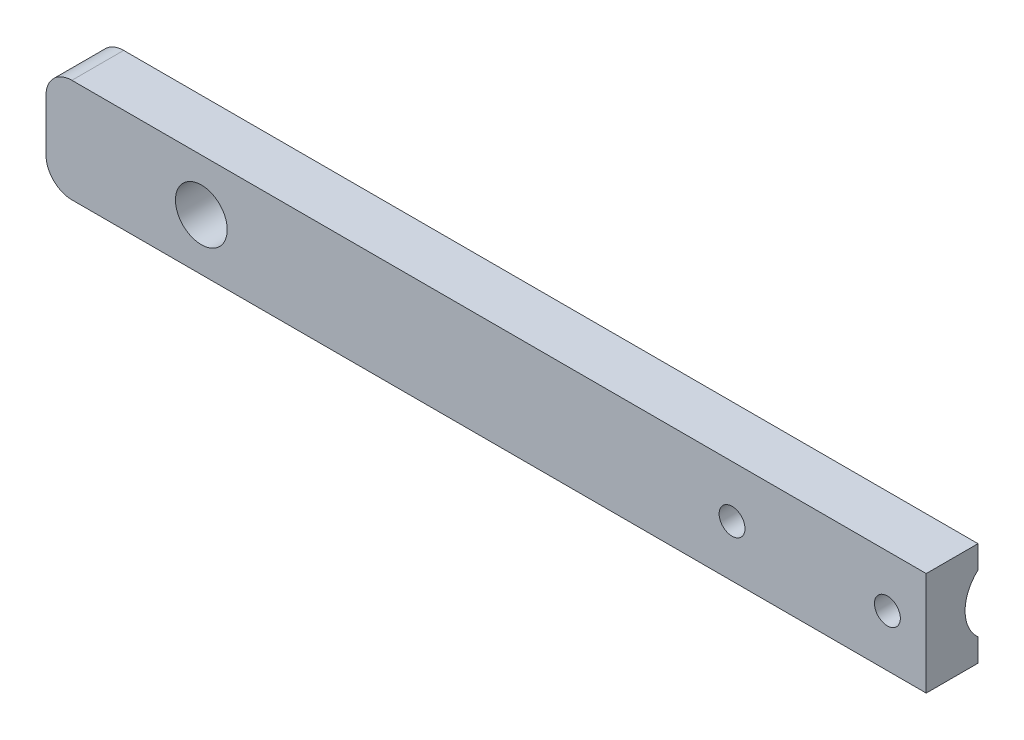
ISO-10303-21;
HEADER;
FILE_DESCRIPTION(('STEP AP214'),'2;1');
FILE_NAME('part.step','',(''),(''),'','','');
FILE_SCHEMA(('AUTOMOTIVE_DESIGN { 1 0 10303 214 1 1 1 1 }'));
ENDSEC;
DATA;
#1=APPLICATION_CONTEXT('core data for automotive mechanical design processes');
#2=APPLICATION_PROTOCOL_DEFINITION('international standard','automotive_design',2000,#1);
#3=PRODUCT_CONTEXT('',#1,'mechanical');
#4=PRODUCT('Part','Part','',(#3));
#5=PRODUCT_RELATED_PRODUCT_CATEGORY('part','',(#4));
#6=PRODUCT_DEFINITION_FORMATION('','',#4);
#7=PRODUCT_DEFINITION_CONTEXT('part definition',#1,'design');
#8=PRODUCT_DEFINITION('design','',#6,#7);
#9=PRODUCT_DEFINITION_SHAPE('','',#8);
#10=(LENGTH_UNIT() NAMED_UNIT(*) SI_UNIT(.MILLI.,.METRE.));
#11=(NAMED_UNIT(*) PLANE_ANGLE_UNIT() SI_UNIT($,.RADIAN.));
#12=(NAMED_UNIT(*) SI_UNIT($,.STERADIAN.) SOLID_ANGLE_UNIT());
#13=UNCERTAINTY_MEASURE_WITH_UNIT(LENGTH_MEASURE(1.E-05),#10,'distance_accuracy_value','');
#14=(GEOMETRIC_REPRESENTATION_CONTEXT(3) GLOBAL_UNCERTAINTY_ASSIGNED_CONTEXT((#13)) GLOBAL_UNIT_ASSIGNED_CONTEXT((#10,
#11,#12)) REPRESENTATION_CONTEXT('',''));
#15=CARTESIAN_POINT('',(0.,0.,0.));
#16=DIRECTION('',(0.,0.,1.));
#17=DIRECTION('',(1.,0.,0.));
#18=AXIS2_PLACEMENT_3D('',#15,#16,#17);
#19=CARTESIAN_POINT('',(0.,0.,6.35));
#20=DIRECTION('',(0.,0.,1.));
#21=DIRECTION('',(1.,0.,0.));
#22=AXIS2_PLACEMENT_3D('',#19,#20,#21);
#23=PLANE('',#22);
#24=CARTESIAN_POINT('',(168.275,0.,6.35));
#25=DIRECTION('',(0.,0.,1.));
#26=DIRECTION('',(1.,0.,0.));
#27=AXIS2_PLACEMENT_3D('',#24,#25,#26);
#28=CIRCLE('',#27,3.175);
#29=CARTESIAN_POINT('',(171.45,0.,6.35));
#30=VERTEX_POINT('',#29);
#31=EDGE_CURVE('E127',#30,#30,#28,.T.);
#32=ORIENTED_EDGE('',*,*,#31,.F.);
#33=EDGE_LOOP('',(#32));
#34=FACE_BOUND('',#33,.T.);
#35=DIRECTION('',(0.,-1.,0.));
#36=VECTOR('',#35,1.);
#37=CARTESIAN_POINT('',(-38.1,12.7,6.35));
#38=LINE('',#37,#36);
#39=CARTESIAN_POINT('',(-38.1,6.35,6.35));
#40=VERTEX_POINT('',#39);
#41=CARTESIAN_POINT('',(-38.1,-6.35,6.35));
#42=VERTEX_POINT('',#41);
#43=EDGE_CURVE('E137',#40,#42,#38,.T.);
#44=ORIENTED_EDGE('',*,*,#43,.T.);
#45=CARTESIAN_POINT('',(-31.75,-6.35,6.35));
#46=DIRECTION('',(0.,0.,1.));
#47=DIRECTION('',(1.,0.,0.));
#48=AXIS2_PLACEMENT_3D('',#45,#46,#47);
#49=CIRCLE('',#48,6.35);
#50=CARTESIAN_POINT('',(-31.75,-12.7,6.35));
#51=VERTEX_POINT('',#50);
#52=EDGE_CURVE('E175',#42,#51,#49,.T.);
#53=ORIENTED_EDGE('',*,*,#52,.T.);
#54=DIRECTION('',(1.,0.,0.));
#55=VECTOR('',#54,1.);
#56=CARTESIAN_POINT('',(-38.1,-12.7,6.35));
#57=LINE('',#56,#55);
#58=CARTESIAN_POINT('',(177.8,-12.7,6.35));
#59=VERTEX_POINT('',#58);
#60=EDGE_CURVE('E140',#51,#59,#57,.T.);
#61=ORIENTED_EDGE('',*,*,#60,.T.);
#62=DIRECTION('',(0.,1.,0.));
#63=VECTOR('',#62,1.);
#64=CARTESIAN_POINT('',(177.8,-12.7,6.35));
#65=LINE('',#64,#63);
#66=CARTESIAN_POINT('',(177.8,12.7,6.35));
#67=VERTEX_POINT('',#66);
#68=EDGE_CURVE('E143',#59,#67,#65,.T.);
#69=ORIENTED_EDGE('',*,*,#68,.T.);
#70=DIRECTION('',(-1.,0.,0.));
#71=VECTOR('',#70,1.);
#72=CARTESIAN_POINT('',(177.8,12.7,6.35));
#73=LINE('',#72,#71);
#74=CARTESIAN_POINT('',(-31.7499999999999,12.7,6.35));
#75=VERTEX_POINT('',#74);
#76=EDGE_CURVE('E145',#67,#75,#73,.T.);
#77=ORIENTED_EDGE('',*,*,#76,.T.);
#78=CARTESIAN_POINT('',(-31.75,6.35,6.35));
#79=DIRECTION('',(0.,0.,1.));
#80=DIRECTION('',(1.,0.,0.));
#81=AXIS2_PLACEMENT_3D('',#78,#79,#80);
#82=CIRCLE('',#81,6.35);
#83=EDGE_CURVE('E173',#75,#40,#82,.T.);
#84=ORIENTED_EDGE('',*,*,#83,.T.);
#85=EDGE_LOOP('',(#44,#53,#61,#69,#77,#84));
#86=FACE_BOUND('',#85,.T.);
#87=CARTESIAN_POINT('',(0.,0.,6.35));
#88=DIRECTION('',(0.,0.,1.));
#89=DIRECTION('',(1.,0.,0.));
#90=AXIS2_PLACEMENT_3D('',#87,#88,#89);
#91=CIRCLE('',#90,6.35);
#92=CARTESIAN_POINT('',(6.35,0.,6.35));
#93=VERTEX_POINT('',#92);
#94=EDGE_CURVE('E131',#93,#93,#91,.T.);
#95=ORIENTED_EDGE('',*,*,#94,.F.);
#96=EDGE_LOOP('',(#95));
#97=FACE_BOUND('',#96,.T.);
#98=CARTESIAN_POINT('',(130.175,0.,6.35));
#99=DIRECTION('',(0.,0.,1.));
#100=DIRECTION('',(1.,0.,0.));
#101=AXIS2_PLACEMENT_3D('',#98,#99,#100);
#102=CIRCLE('',#101,3.175);
#103=CARTESIAN_POINT('',(133.35,0.,6.35));
#104=VERTEX_POINT('',#103);
#105=EDGE_CURVE('E115',#104,#104,#102,.T.);
#106=ORIENTED_EDGE('',*,*,#105,.F.);
#107=EDGE_LOOP('',(#106));
#108=FACE_BOUND('',#107,.T.);
#109=ADVANCED_FACE('F33',(#34,#86,#97,#108),#23,.T.);
#110=CARTESIAN_POINT('',(0.,0.,-6.35));
#111=DIRECTION('',(0.,0.,1.));
#112=DIRECTION('',(1.,0.,0.));
#113=AXIS2_PLACEMENT_3D('',#110,#111,#112);
#114=PLANE('',#113);
#115=DIRECTION('',(0.,1.,0.));
#116=VECTOR('',#115,1.);
#117=CARTESIAN_POINT('',(120.65,0.,-6.35));
#118=LINE('',#117,#116);
#119=CARTESIAN_POINT('',(120.65,-7.09951582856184,-6.35));
#120=VERTEX_POINT('',#119);
#121=CARTESIAN_POINT('',(120.65,7.09951582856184,-6.35));
#122=VERTEX_POINT('',#121);
#123=EDGE_CURVE('E11',#120,#122,#118,.T.);
#124=ORIENTED_EDGE('',*,*,#123,.F.);
#125=DIRECTION('',(1.,0.,0.));
#126=VECTOR('',#125,1.);
#127=CARTESIAN_POINT('',(120.65,-7.09951582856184,-6.35));
#128=LINE('',#127,#126);
#129=CARTESIAN_POINT('',(177.8,-7.09951582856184,-6.35));
#130=VERTEX_POINT('',#129);
#131=EDGE_CURVE('E104',#120,#130,#128,.T.);
#132=ORIENTED_EDGE('',*,*,#131,.T.);
#133=DIRECTION('',(0.,1.,0.));
#134=VECTOR('',#133,1.);
#135=CARTESIAN_POINT('',(177.8,-12.7,-6.35));
#136=LINE('',#135,#134);
#137=CARTESIAN_POINT('',(177.8,-12.7,-6.35));
#138=VERTEX_POINT('',#137);
#139=EDGE_CURVE('E152',#138,#130,#136,.T.);
#140=ORIENTED_EDGE('',*,*,#139,.F.);
#141=DIRECTION('',(1.,0.,0.));
#142=VECTOR('',#141,1.);
#143=CARTESIAN_POINT('',(-38.1,-12.7,-6.35));
#144=LINE('',#143,#142);
#145=CARTESIAN_POINT('',(-31.75,-12.7,-6.35));
#146=VERTEX_POINT('',#145);
#147=EDGE_CURVE('E150',#146,#138,#144,.T.);
#148=ORIENTED_EDGE('',*,*,#147,.F.);
#149=CARTESIAN_POINT('',(-31.75,-6.35,-6.35));
#150=DIRECTION('',(0.,0.,1.));
#151=DIRECTION('',(1.,0.,0.));
#152=AXIS2_PLACEMENT_3D('',#149,#150,#151);
#153=CIRCLE('',#152,6.35);
#154=CARTESIAN_POINT('',(-38.1,-6.35,-6.35));
#155=VERTEX_POINT('',#154);
#156=EDGE_CURVE('E166',#146,#155,#153,.F.);
#157=ORIENTED_EDGE('',*,*,#156,.T.);
#158=DIRECTION('',(0.,-1.,0.));
#159=VECTOR('',#158,1.);
#160=CARTESIAN_POINT('',(-38.1,12.7,-6.35));
#161=LINE('',#160,#159);
#162=CARTESIAN_POINT('',(-38.1,6.35,-6.35));
#163=VERTEX_POINT('',#162);
#164=EDGE_CURVE('E134',#163,#155,#161,.T.);
#165=ORIENTED_EDGE('',*,*,#164,.F.);
#166=CARTESIAN_POINT('',(-31.75,6.35,-6.35));
#167=DIRECTION('',(0.,0.,1.));
#168=DIRECTION('',(1.,0.,0.));
#169=AXIS2_PLACEMENT_3D('',#166,#167,#168);
#170=CIRCLE('',#169,6.35);
#171=CARTESIAN_POINT('',(-31.7499999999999,12.7,-6.35));
#172=VERTEX_POINT('',#171);
#173=EDGE_CURVE('E164',#163,#172,#170,.F.);
#174=ORIENTED_EDGE('',*,*,#173,.T.);
#175=DIRECTION('',(-1.,0.,0.));
#176=VECTOR('',#175,1.);
#177=CARTESIAN_POINT('',(177.8,12.7,-6.35));
#178=LINE('',#177,#176);
#179=CARTESIAN_POINT('',(177.8,12.7,-6.35));
#180=VERTEX_POINT('',#179);
#181=EDGE_CURVE('E141',#180,#172,#178,.T.);
#182=ORIENTED_EDGE('',*,*,#181,.F.);
#183=CARTESIAN_POINT('',(177.8,7.09951582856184,-6.35));
#184=VERTEX_POINT('',#183);
#185=EDGE_CURVE('E112',#184,#180,#136,.T.);
#186=ORIENTED_EDGE('',*,*,#185,.F.);
#187=DIRECTION('',(1.,0.,0.));
#188=VECTOR('',#187,1.);
#189=CARTESIAN_POINT('',(120.65,7.09951582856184,-6.35));
#190=LINE('',#189,#188);
#191=EDGE_CURVE('E48',#184,#122,#190,.F.);
#192=ORIENTED_EDGE('',*,*,#191,.T.);
#193=EDGE_LOOP('',(#124,#132,#140,#148,#157,#165,#174,#182,#186,#192));
#194=FACE_BOUND('',#193,.T.);
#195=CARTESIAN_POINT('',(0.,0.,-6.35));
#196=DIRECTION('',(0.,0.,1.));
#197=DIRECTION('',(1.,0.,0.));
#198=AXIS2_PLACEMENT_3D('',#195,#196,#197);
#199=CIRCLE('',#198,6.35);
#200=CARTESIAN_POINT('',(6.35,0.,-6.35));
#201=VERTEX_POINT('',#200);
#202=EDGE_CURVE('E130',#201,#201,#199,.T.);
#203=ORIENTED_EDGE('',*,*,#202,.T.);
#204=EDGE_LOOP('',(#203));
#205=FACE_BOUND('',#204,.T.);
#206=ADVANCED_FACE('F109',(#194,#205),#114,.F.);
#207=CARTESIAN_POINT('',(-38.1,12.7,6.35));
#208=DIRECTION('',(1.,0.,0.));
#209=DIRECTION('',(0.,0.,-1.));
#210=AXIS2_PLACEMENT_3D('',#207,#208,#209);
#211=PLANE('',#210);
#212=ORIENTED_EDGE('',*,*,#164,.T.);
#213=DIRECTION('',(0.,0.,-1.));
#214=VECTOR('',#213,1.);
#215=CARTESIAN_POINT('',(-38.1,-6.35,6.35));
#216=LINE('',#215,#214);
#217=EDGE_CURVE('E171',#155,#42,#216,.F.);
#218=ORIENTED_EDGE('',*,*,#217,.T.);
#219=ORIENTED_EDGE('',*,*,#43,.F.);
#220=DIRECTION('',(0.,0.,-1.));
#221=VECTOR('',#220,1.);
#222=CARTESIAN_POINT('',(-38.1,6.35,6.35));
#223=LINE('',#222,#221);
#224=EDGE_CURVE('E168',#40,#163,#223,.T.);
#225=ORIENTED_EDGE('',*,*,#224,.T.);
#226=EDGE_LOOP('',(#212,#218,#219,#225));
#227=FACE_BOUND('',#226,.T.);
#228=ADVANCED_FACE('F200',(#227),#211,.F.);
#229=CARTESIAN_POINT('',(-38.1,-12.7,6.35));
#230=DIRECTION('',(0.,1.,0.));
#231=DIRECTION('',(0.,0.,1.));
#232=AXIS2_PLACEMENT_3D('',#229,#230,#231);
#233=PLANE('',#232);
#234=ORIENTED_EDGE('',*,*,#60,.F.);
#235=DIRECTION('',(0.,0.,-1.));
#236=VECTOR('',#235,1.);
#237=CARTESIAN_POINT('',(-31.75,-12.7,6.35));
#238=LINE('',#237,#236);
#239=EDGE_CURVE('E161',#51,#146,#238,.T.);
#240=ORIENTED_EDGE('',*,*,#239,.T.);
#241=ORIENTED_EDGE('',*,*,#147,.T.);
#242=DIRECTION('',(0.,0.,-1.));
#243=VECTOR('',#242,1.);
#244=CARTESIAN_POINT('',(177.8,-12.7,6.35));
#245=LINE('',#244,#243);
#246=EDGE_CURVE('E158',#59,#138,#245,.T.);
#247=ORIENTED_EDGE('',*,*,#246,.F.);
#248=EDGE_LOOP('',(#234,#240,#241,#247));
#249=FACE_BOUND('',#248,.T.);
#250=ADVANCED_FACE('F213',(#249),#233,.F.);
#251=CARTESIAN_POINT('',(177.8,-12.7,6.35));
#252=DIRECTION('',(-1.,0.,0.));
#253=DIRECTION('',(0.,0.,1.));
#254=AXIS2_PLACEMENT_3D('',#251,#252,#253);
#255=PLANE('',#254);
#256=ORIENTED_EDGE('',*,*,#139,.T.);
#257=CARTESIAN_POINT('',(177.8,0.,-12.7));
#258=DIRECTION('',(1.,0.,0.));
#259=DIRECTION('',(0.,0.,-1.));
#260=AXIS2_PLACEMENT_3D('',#257,#258,#259);
#261=CIRCLE('',#260,9.525);
#262=EDGE_CURVE('E106',#184,#130,#261,.T.);
#263=ORIENTED_EDGE('',*,*,#262,.F.);
#264=ORIENTED_EDGE('',*,*,#185,.T.);
#265=DIRECTION('',(0.,0.,-1.));
#266=VECTOR('',#265,1.);
#267=CARTESIAN_POINT('',(177.8,12.7,6.35));
#268=LINE('',#267,#266);
#269=EDGE_CURVE('E147',#67,#180,#268,.T.);
#270=ORIENTED_EDGE('',*,*,#269,.F.);
#271=ORIENTED_EDGE('',*,*,#68,.F.);
#272=ORIENTED_EDGE('',*,*,#246,.T.);
#273=EDGE_LOOP('',(#256,#263,#264,#270,#271,#272));
#274=FACE_BOUND('',#273,.T.);
#275=ADVANCED_FACE('F210',(#274),#255,.F.);
#276=CARTESIAN_POINT('',(177.8,12.7,6.35));
#277=DIRECTION('',(0.,-1.,0.));
#278=DIRECTION('',(0.,0.,-1.));
#279=AXIS2_PLACEMENT_3D('',#276,#277,#278);
#280=PLANE('',#279);
#281=ORIENTED_EDGE('',*,*,#181,.T.);
#282=DIRECTION('',(0.,0.,-1.));
#283=VECTOR('',#282,1.);
#284=CARTESIAN_POINT('',(-31.75,12.7,6.35));
#285=LINE('',#284,#283);
#286=EDGE_CURVE('E41',#172,#75,#285,.F.);
#287=ORIENTED_EDGE('',*,*,#286,.T.);
#288=ORIENTED_EDGE('',*,*,#76,.F.);
#289=ORIENTED_EDGE('',*,*,#269,.T.);
#290=EDGE_LOOP('',(#281,#287,#288,#289));
#291=FACE_BOUND('',#290,.T.);
#292=ADVANCED_FACE('F207',(#291),#280,.F.);
#293=CARTESIAN_POINT('',(0.,0.,6.35));
#294=DIRECTION('',(0.,0.,-1.));
#295=DIRECTION('',(-1.,0.,0.));
#296=AXIS2_PLACEMENT_3D('',#293,#294,#295);
#297=CYLINDRICAL_SURFACE('',#296,6.35);
#298=ORIENTED_EDGE('',*,*,#94,.T.);
#299=EDGE_LOOP('',(#298));
#300=FACE_BOUND('',#299,.T.);
#301=ORIENTED_EDGE('',*,*,#202,.F.);
#302=EDGE_LOOP('',(#301));
#303=FACE_BOUND('',#302,.T.);
#304=ADVANCED_FACE('F205',(#300,#303),#297,.F.);
#305=CARTESIAN_POINT('',(168.275,0.,6.35));
#306=DIRECTION('',(0.,0.,-1.));
#307=DIRECTION('',(-1.,0.,0.));
#308=AXIS2_PLACEMENT_3D('',#305,#306,#307);
#309=CYLINDRICAL_SURFACE('',#308,3.175);
#310=CARTESIAN_POINT('',(165.1,0.,-3.17499999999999));
#311=CARTESIAN_POINT('',(165.099999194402,-0.173238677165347,-3.17499951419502));
#312=CARTESIAN_POINT('',(165.114224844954,-0.346472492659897,-3.17976981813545));
#313=CARTESIAN_POINT('',(165.170577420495,-0.687837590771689,-3.19832957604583));
#314=CARTESIAN_POINT('',(165.212707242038,-0.855968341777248,-3.21211996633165));
#315=CARTESIAN_POINT('',(165.323263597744,-1.18215660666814,-3.24722147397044));
#316=CARTESIAN_POINT('',(165.391646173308,-1.34023044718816,-3.2685200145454));
#317=CARTESIAN_POINT('',(165.552568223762,-1.6426654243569,-3.31646384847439));
#318=CARTESIAN_POINT('',(165.645112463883,-1.78702384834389,-3.34311019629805));
#319=CARTESIAN_POINT('',(165.855096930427,-2.0629298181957,-3.39997750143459));
#320=CARTESIAN_POINT('',(165.973224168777,-2.19393674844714,-3.43028408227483));
#321=CARTESIAN_POINT('',(166.229560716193,-2.43469379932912,-3.49058500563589));
#322=CARTESIAN_POINT('',(166.367774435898,-2.54443923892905,-3.52057927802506));
#323=CARTESIAN_POINT('',(166.665227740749,-2.74264419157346,-3.57780169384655));
#324=CARTESIAN_POINT('',(166.824957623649,-2.83040092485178,-3.6049255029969));
#325=CARTESIAN_POINT('',(167.157959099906,-2.97757492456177,-3.65203405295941));
#326=CARTESIAN_POINT('',(167.331226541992,-3.03700083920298,-3.67202097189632));
#327=CARTESIAN_POINT('',(167.680237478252,-3.12379824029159,-3.70169112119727));
#328=CARTESIAN_POINT('',(167.855700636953,-3.15218269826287,-3.71169895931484));
#329=CARTESIAN_POINT('',(168.209162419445,-3.17925806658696,-3.72123790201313));
#330=CARTESIAN_POINT('',(168.387160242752,-3.17795815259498,-3.72077224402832));
#331=CARTESIAN_POINT('',(168.73199880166,-3.14648819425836,-3.70970127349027));
#332=CARTESIAN_POINT('',(168.898977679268,-3.11764017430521,-3.69956029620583));
#333=CARTESIAN_POINT('',(169.225574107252,-3.03404956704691,-3.67104111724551));
#334=CARTESIAN_POINT('',(169.385190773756,-2.9793038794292,-3.65266192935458));
#335=CARTESIAN_POINT('',(169.695535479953,-2.84460650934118,-3.60940632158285));
#336=CARTESIAN_POINT('',(169.846078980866,-2.76426310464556,-3.58443003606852));
#337=CARTESIAN_POINT('',(170.131965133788,-2.58092291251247,-3.53083626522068));
#338=CARTESIAN_POINT('',(170.267303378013,-2.47791958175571,-3.50221772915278));
#339=CARTESIAN_POINT('',(170.52636582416,-2.2458341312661,-3.44273729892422));
#340=CARTESIAN_POINT('',(170.649114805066,-2.11567125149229,-3.41183628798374));
#341=CARTESIAN_POINT('',(170.871296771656,-1.83622813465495,-3.35257970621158));
#342=CARTESIAN_POINT('',(170.970727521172,-1.68694606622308,-3.32422437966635));
#343=CARTESIAN_POINT('',(171.144235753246,-1.37143367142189,-3.27288182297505));
#344=CARTESIAN_POINT('',(171.218051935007,-1.20504990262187,-3.24995063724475));
#345=CARTESIAN_POINT('',(171.336345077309,-0.861279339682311,-3.21244699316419));
#346=CARTESIAN_POINT('',(171.380832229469,-0.683896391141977,-3.19787163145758));
#347=CARTESIAN_POINT('',(171.437476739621,-0.331418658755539,-3.17920284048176));
#348=CARTESIAN_POINT('',(171.450951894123,-0.156557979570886,-3.17468244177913));
#349=CARTESIAN_POINT('',(171.448943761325,0.192960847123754,-3.17535233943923));
#350=CARTESIAN_POINT('',(171.433465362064,0.36761902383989,-3.18054099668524));
#351=CARTESIAN_POINT('',(171.375032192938,0.70650057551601,-3.19976421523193));
#352=CARTESIAN_POINT('',(171.332886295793,0.870879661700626,-3.21353819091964));
#353=CARTESIAN_POINT('',(171.223325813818,1.19016766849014,-3.24828386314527));
#354=CARTESIAN_POINT('',(171.15590800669,1.34507537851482,-3.26925647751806));
#355=CARTESIAN_POINT('',(170.995751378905,1.64556534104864,-3.31695643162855));
#356=CARTESIAN_POINT('',(170.902393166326,1.79079512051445,-3.34382063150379));
#357=CARTESIAN_POINT('',(170.693733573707,2.06395583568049,-3.40025818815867));
#358=CARTESIAN_POINT('',(170.578425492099,2.19188146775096,-3.42983237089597));
#359=CARTESIAN_POINT('',(170.322942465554,2.43285171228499,-3.49006007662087));
#360=CARTESIAN_POINT('',(170.181875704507,2.54495607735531,-3.52070158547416));
#361=CARTESIAN_POINT('',(169.8822752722,2.74401763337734,-3.57822584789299));
#362=CARTESIAN_POINT('',(169.723741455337,2.83097461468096,-3.60510857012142));
#363=CARTESIAN_POINT('',(169.393638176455,2.97687025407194,-3.65180906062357));
#364=CARTESIAN_POINT('',(169.222095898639,3.03586556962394,-3.67164109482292));
#365=CARTESIAN_POINT('',(168.87069778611,3.12386556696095,-3.70170607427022));
#366=CARTESIAN_POINT('',(168.690845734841,3.15288375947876,-3.71194334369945));
#367=CARTESIAN_POINT('',(168.33787422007,3.17905219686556,-3.72116798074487));
#368=CARTESIAN_POINT('',(168.164883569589,3.17776306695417,-3.72070629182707));
#369=CARTESIAN_POINT('',(167.821720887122,3.1471942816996,-3.70994718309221));
#370=CARTESIAN_POINT('',(167.651548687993,3.11791629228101,-3.69965034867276));
#371=CARTESIAN_POINT('',(167.322069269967,3.03330550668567,-3.67079135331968));
#372=CARTESIAN_POINT('',(167.162617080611,2.97847812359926,-3.65238988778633));
#373=CARTESIAN_POINT('',(166.855052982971,2.8447344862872,-3.60945433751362));
#374=CARTESIAN_POINT('',(166.706943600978,2.76581288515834,-3.58491889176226));
#375=CARTESIAN_POINT('',(166.419264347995,2.5821026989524,-3.53114517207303));
#376=CARTESIAN_POINT('',(166.280349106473,2.47633567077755,-3.50174840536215));
#377=CARTESIAN_POINT('',(166.021734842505,2.2435911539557,-3.44222843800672));
#378=CARTESIAN_POINT('',(165.90204127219,2.11660766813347,-3.41210503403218));
#379=CARTESIAN_POINT('',(165.680566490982,1.8390919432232,-3.35311653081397));
#380=CARTESIAN_POINT('',(165.579665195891,1.68783480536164,-3.3243462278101));
#381=CARTESIAN_POINT('',(165.404830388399,1.36955960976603,-3.27259978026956));
#382=CARTESIAN_POINT('',(165.330889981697,1.20254559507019,-3.24962215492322));
#383=CARTESIAN_POINT('',(165.215183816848,0.865167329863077,-3.21292489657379));
#384=CARTESIAN_POINT('',(165.172128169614,0.69528613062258,-3.1988375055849));
#385=CARTESIAN_POINT('',(165.11454060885,0.350267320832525,-3.17987657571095));
#386=CARTESIAN_POINT('',(165.100000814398,0.175131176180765,-3.17500049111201));
#387=CARTESIAN_POINT('',(165.1,0.,-3.17499999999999));
#388=B_SPLINE_CURVE_WITH_KNOTS('',3,(#310,#311,#312,#313,#314,#315,#316,#317,#318,#319,#320,
#321,#322,#323,#324,#325,#326,#327,#328,#329,#330,#331,#332,#333,#334,#335,#336,#337,#338,#339,
#340,#341,#342,#343,#344,#345,#346,#347,#348,#349,#350,#351,#352,#353,#354,#355,#356,#357,#358,
#359,#360,#361,#362,#363,#364,#365,#366,#367,#368,#369,#370,#371,#372,#373,#374,#375,#376,#377,
#378,#379,#380,#381,#382,#383,#384,#385,#386,#387),.UNSPECIFIED.,.T.,.F.,(4,2,2,2,2,2,2,2,2,2,2,
2,2,2,2,2,2,2,2,2,2,2,2,2,2,2,2,2,2,2,2,2,2,2,2,2,2,2,4),(0.,0.519071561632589,1.03819701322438,
1.55645698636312,2.07481924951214,2.60936372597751,3.1440257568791,3.69406121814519,
4.24392866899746,4.77526114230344,5.30642937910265,5.81332424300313,6.32027980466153,
6.83539943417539,7.35066800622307,7.8928374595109,8.43505888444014,8.98265937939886,
9.53006948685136,10.0537512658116,10.5773446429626,11.0857715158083,11.5942632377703,
12.1161301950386,12.638156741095,13.1839024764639,13.7296527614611,14.2742924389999,
14.8186865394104,15.3351123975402,15.8515075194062,16.3580948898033,16.8647947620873,
17.3936046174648,17.92256420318,18.4721392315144,19.0215736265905,19.5464607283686,
20.0712027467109),.UNSPECIFIED.);
#389=CARTESIAN_POINT('',(165.1,0.,-3.17499999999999));
#390=VERTEX_POINT('',#389);
#391=EDGE_CURVE('E113',#390,#390,#388,.T.);
#392=ORIENTED_EDGE('',*,*,#391,.F.);
#393=EDGE_LOOP('',(#392));
#394=FACE_BOUND('',#393,.T.);
#395=ORIENTED_EDGE('',*,*,#31,.T.);
#396=EDGE_LOOP('',(#395));
#397=FACE_BOUND('',#396,.T.);
#398=ADVANCED_FACE('F225',(#394,#397),#309,.F.);
#399=CARTESIAN_POINT('',(130.175,0.,6.35));
#400=DIRECTION('',(0.,0.,-1.));
#401=DIRECTION('',(-1.,0.,0.));
#402=AXIS2_PLACEMENT_3D('',#399,#400,#401);
#403=CYLINDRICAL_SURFACE('',#402,3.175);
#404=CARTESIAN_POINT('',(127.,0.,-3.17499999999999));
#405=CARTESIAN_POINT('',(126.999999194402,-0.173238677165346,-3.17499951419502));
#406=CARTESIAN_POINT('',(127.014224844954,-0.346472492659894,-3.17976981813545));
#407=CARTESIAN_POINT('',(127.070577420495,-0.687837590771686,-3.19832957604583));
#408=CARTESIAN_POINT('',(127.112707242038,-0.855968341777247,-3.21211996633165));
#409=CARTESIAN_POINT('',(127.223263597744,-1.18215660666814,-3.24722147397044));
#410=CARTESIAN_POINT('',(127.291646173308,-1.34023044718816,-3.2685200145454));
#411=CARTESIAN_POINT('',(127.452568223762,-1.6426654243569,-3.31646384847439));
#412=CARTESIAN_POINT('',(127.545112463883,-1.78702384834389,-3.34311019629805));
#413=CARTESIAN_POINT('',(127.755096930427,-2.0629298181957,-3.39997750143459));
#414=CARTESIAN_POINT('',(127.873224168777,-2.19393674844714,-3.43028408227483));
#415=CARTESIAN_POINT('',(128.129560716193,-2.43469379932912,-3.49058500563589));
#416=CARTESIAN_POINT('',(128.267774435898,-2.54443923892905,-3.52057927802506));
#417=CARTESIAN_POINT('',(128.565227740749,-2.74264419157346,-3.57780169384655));
#418=CARTESIAN_POINT('',(128.724957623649,-2.83040092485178,-3.6049255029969));
#419=CARTESIAN_POINT('',(129.057959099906,-2.97757492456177,-3.65203405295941));
#420=CARTESIAN_POINT('',(129.231226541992,-3.03700083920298,-3.67202097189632));
#421=CARTESIAN_POINT('',(129.580237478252,-3.12379824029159,-3.70169112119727));
#422=CARTESIAN_POINT('',(129.755700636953,-3.15218269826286,-3.71169895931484));
#423=CARTESIAN_POINT('',(130.109162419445,-3.17925806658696,-3.72123790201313));
#424=CARTESIAN_POINT('',(130.287160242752,-3.17795815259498,-3.72077224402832));
#425=CARTESIAN_POINT('',(130.63199880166,-3.14648819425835,-3.70970127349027));
#426=CARTESIAN_POINT('',(130.798977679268,-3.11764017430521,-3.69956029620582));
#427=CARTESIAN_POINT('',(131.125574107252,-3.0340495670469,-3.6710411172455));
#428=CARTESIAN_POINT('',(131.285190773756,-2.9793038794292,-3.65266192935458));
#429=CARTESIAN_POINT('',(131.595535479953,-2.84460650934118,-3.60940632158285));
#430=CARTESIAN_POINT('',(131.746078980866,-2.76426310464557,-3.58443003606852));
#431=CARTESIAN_POINT('',(132.031965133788,-2.58092291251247,-3.53083626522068));
#432=CARTESIAN_POINT('',(132.167303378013,-2.47791958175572,-3.50221772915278));
#433=CARTESIAN_POINT('',(132.42636582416,-2.2458341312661,-3.44273729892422));
#434=CARTESIAN_POINT('',(132.549114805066,-2.11567125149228,-3.41183628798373));
#435=CARTESIAN_POINT('',(132.771296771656,-1.83622813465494,-3.35257970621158));
#436=CARTESIAN_POINT('',(132.870727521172,-1.68694606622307,-3.32422437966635));
#437=CARTESIAN_POINT('',(133.044235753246,-1.37143367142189,-3.27288182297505));
#438=CARTESIAN_POINT('',(133.118051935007,-1.20504990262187,-3.24995063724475));
#439=CARTESIAN_POINT('',(133.236345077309,-0.861279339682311,-3.21244699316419));
#440=CARTESIAN_POINT('',(133.280832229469,-0.683896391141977,-3.19787163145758));
#441=CARTESIAN_POINT('',(133.337476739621,-0.331418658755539,-3.17920284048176));
#442=CARTESIAN_POINT('',(133.350951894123,-0.156557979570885,-3.17468244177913));
#443=CARTESIAN_POINT('',(133.348943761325,0.192960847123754,-3.17535233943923));
#444=CARTESIAN_POINT('',(133.333465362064,0.36761902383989,-3.18054099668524));
#445=CARTESIAN_POINT('',(133.275032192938,0.706500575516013,-3.19976421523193));
#446=CARTESIAN_POINT('',(133.232886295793,0.870879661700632,-3.21353819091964));
#447=CARTESIAN_POINT('',(133.123325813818,1.19016766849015,-3.24828386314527));
#448=CARTESIAN_POINT('',(133.05590800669,1.34507537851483,-3.26925647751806));
#449=CARTESIAN_POINT('',(132.895751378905,1.64556534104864,-3.31695643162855));
#450=CARTESIAN_POINT('',(132.802393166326,1.79079512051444,-3.34382063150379));
#451=CARTESIAN_POINT('',(132.593733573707,2.06395583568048,-3.40025818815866));
#452=CARTESIAN_POINT('',(132.478425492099,2.19188146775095,-3.42983237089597));
#453=CARTESIAN_POINT('',(132.222942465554,2.432851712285,-3.49006007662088));
#454=CARTESIAN_POINT('',(132.081875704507,2.54495607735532,-3.52070158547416));
#455=CARTESIAN_POINT('',(131.7822752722,2.74401763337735,-3.57822584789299));
#456=CARTESIAN_POINT('',(131.623741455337,2.83097461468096,-3.60510857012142));
#457=CARTESIAN_POINT('',(131.293638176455,2.97687025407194,-3.65180906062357));
#458=CARTESIAN_POINT('',(131.122095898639,3.03586556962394,-3.67164109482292));
#459=CARTESIAN_POINT('',(130.77069778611,3.12386556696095,-3.70170607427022));
#460=CARTESIAN_POINT('',(130.590845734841,3.15288375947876,-3.71194334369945));
#461=CARTESIAN_POINT('',(130.23787422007,3.17905219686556,-3.72116798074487));
#462=CARTESIAN_POINT('',(130.064883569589,3.17776306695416,-3.72070629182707));
#463=CARTESIAN_POINT('',(129.721720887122,3.1471942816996,-3.70994718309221));
#464=CARTESIAN_POINT('',(129.551548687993,3.11791629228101,-3.69965034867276));
#465=CARTESIAN_POINT('',(129.222069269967,3.03330550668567,-3.67079135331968));
#466=CARTESIAN_POINT('',(129.062617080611,2.97847812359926,-3.65238988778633));
#467=CARTESIAN_POINT('',(128.755052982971,2.84473448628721,-3.60945433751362));
#468=CARTESIAN_POINT('',(128.606943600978,2.76581288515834,-3.58491889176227));
#469=CARTESIAN_POINT('',(128.319264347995,2.5821026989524,-3.53114517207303));
#470=CARTESIAN_POINT('',(128.180349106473,2.47633567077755,-3.50174840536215));
#471=CARTESIAN_POINT('',(127.921734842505,2.2435911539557,-3.44222843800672));
#472=CARTESIAN_POINT('',(127.80204127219,2.11660766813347,-3.41210503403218));
#473=CARTESIAN_POINT('',(127.580566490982,1.8390919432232,-3.35311653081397));
#474=CARTESIAN_POINT('',(127.479665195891,1.68783480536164,-3.3243462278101));
#475=CARTESIAN_POINT('',(127.304830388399,1.36955960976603,-3.27259978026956));
#476=CARTESIAN_POINT('',(127.230889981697,1.20254559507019,-3.24962215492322));
#477=CARTESIAN_POINT('',(127.115183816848,0.865167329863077,-3.21292489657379));
#478=CARTESIAN_POINT('',(127.072128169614,0.69528613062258,-3.1988375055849));
#479=CARTESIAN_POINT('',(127.01454060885,0.350267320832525,-3.17987657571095));
#480=CARTESIAN_POINT('',(127.000000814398,0.175131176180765,-3.17500049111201));
#481=CARTESIAN_POINT('',(127.,0.,-3.17499999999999));
#482=B_SPLINE_CURVE_WITH_KNOTS('',3,(#404,#405,#406,#407,#408,#409,#410,#411,#412,#413,#414,
#415,#416,#417,#418,#419,#420,#421,#422,#423,#424,#425,#426,#427,#428,#429,#430,#431,#432,#433,
#434,#435,#436,#437,#438,#439,#440,#441,#442,#443,#444,#445,#446,#447,#448,#449,#450,#451,#452,
#453,#454,#455,#456,#457,#458,#459,#460,#461,#462,#463,#464,#465,#466,#467,#468,#469,#470,#471,
#472,#473,#474,#475,#476,#477,#478,#479,#480,#481),.UNSPECIFIED.,.T.,.F.,(4,2,2,2,2,2,2,2,2,2,2,
2,2,2,2,2,2,2,2,2,2,2,2,2,2,2,2,2,2,2,2,2,2,2,2,2,2,2,4),(0.,0.519071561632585,1.03819701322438,
1.55645698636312,2.07481924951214,2.60936372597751,3.1440257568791,3.69406121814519,
4.24392866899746,4.77526114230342,5.30642937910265,5.81332424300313,6.32027980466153,
6.83539943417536,7.35066800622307,7.89283745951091,8.43505888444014,8.98265937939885,
9.53006948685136,10.0537512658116,10.5773446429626,11.0857715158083,11.5942632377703,
12.1161301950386,12.638156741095,13.1839024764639,13.7296527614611,14.274292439,
14.8186865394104,15.3351123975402,15.8515075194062,16.3580948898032,16.8647947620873,
17.3936046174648,17.92256420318,18.4721392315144,19.0215736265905,19.5464607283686,
20.0712027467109),.UNSPECIFIED.);
#483=CARTESIAN_POINT('',(127.,0.,-3.17499999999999));
#484=VERTEX_POINT('',#483);
#485=EDGE_CURVE('E105',#484,#484,#482,.T.);
#486=ORIENTED_EDGE('',*,*,#485,.F.);
#487=EDGE_LOOP('',(#486));
#488=FACE_BOUND('',#487,.T.);
#489=ORIENTED_EDGE('',*,*,#105,.T.);
#490=EDGE_LOOP('',(#489));
#491=FACE_BOUND('',#490,.T.);
#492=ADVANCED_FACE('F181',(#488,#491),#403,.F.);
#493=CARTESIAN_POINT('',(-31.75,-6.35,6.35));
#494=DIRECTION('',(0.,0.,-1.));
#495=DIRECTION('',(-1.,0.,0.));
#496=AXIS2_PLACEMENT_3D('',#493,#494,#495);
#497=CYLINDRICAL_SURFACE('',#496,6.35);
#498=ORIENTED_EDGE('',*,*,#52,.F.);
#499=ORIENTED_EDGE('',*,*,#217,.F.);
#500=ORIENTED_EDGE('',*,*,#156,.F.);
#501=ORIENTED_EDGE('',*,*,#239,.F.);
#502=EDGE_LOOP('',(#498,#499,#500,#501));
#503=FACE_BOUND('',#502,.T.);
#504=ADVANCED_FACE('F192',(#503),#497,.T.);
#505=CARTESIAN_POINT('',(-31.75,6.35,6.35));
#506=DIRECTION('',(0.,0.,-1.));
#507=DIRECTION('',(-1.,0.,0.));
#508=AXIS2_PLACEMENT_3D('',#505,#506,#507);
#509=CYLINDRICAL_SURFACE('',#508,6.35);
#510=ORIENTED_EDGE('',*,*,#83,.F.);
#511=ORIENTED_EDGE('',*,*,#286,.F.);
#512=ORIENTED_EDGE('',*,*,#173,.F.);
#513=ORIENTED_EDGE('',*,*,#224,.F.);
#514=EDGE_LOOP('',(#510,#511,#512,#513));
#515=FACE_BOUND('',#514,.T.);
#516=ADVANCED_FACE('F35',(#515),#509,.T.);
#517=CARTESIAN_POINT('',(120.65,0.,-12.7));
#518=DIRECTION('',(1.,0.,0.));
#519=DIRECTION('',(0.,0.,-1.));
#520=AXIS2_PLACEMENT_3D('',#517,#518,#519);
#521=PLANE('',#520);
#522=ORIENTED_EDGE('',*,*,#123,.T.);
#523=CARTESIAN_POINT('',(120.65,0.,-12.7));
#524=DIRECTION('',(1.,0.,0.));
#525=DIRECTION('',(0.,0.,-1.));
#526=AXIS2_PLACEMENT_3D('',#523,#524,#525);
#527=CIRCLE('',#526,9.525);
#528=EDGE_CURVE('E100',#122,#120,#527,.T.);
#529=ORIENTED_EDGE('',*,*,#528,.T.);
#530=EDGE_LOOP('',(#522,#529));
#531=FACE_BOUND('',#530,.T.);
#532=ADVANCED_FACE('F99',(#531),#521,.T.);
#533=CARTESIAN_POINT('',(120.65,0.,-12.7));
#534=DIRECTION('',(1.,0.,0.));
#535=DIRECTION('',(0.,0.,-1.));
#536=AXIS2_PLACEMENT_3D('',#533,#534,#535);
#537=CYLINDRICAL_SURFACE('',#536,9.525);
#538=ORIENTED_EDGE('',*,*,#485,.T.);
#539=EDGE_LOOP('',(#538));
#540=FACE_BOUND('',#539,.T.);
#541=ORIENTED_EDGE('',*,*,#391,.T.);
#542=EDGE_LOOP('',(#541));
#543=FACE_BOUND('',#542,.T.);
#544=ORIENTED_EDGE('',*,*,#528,.F.);
#545=ORIENTED_EDGE('',*,*,#191,.F.);
#546=ORIENTED_EDGE('',*,*,#262,.T.);
#547=ORIENTED_EDGE('',*,*,#131,.F.);
#548=EDGE_LOOP('',(#544,#545,#546,#547));
#549=FACE_BOUND('',#548,.T.);
#550=ADVANCED_FACE('F103',(#540,#543,#549),#537,.F.);
#551=CLOSED_SHELL('',(#109,#206,#228,#250,#275,#292,#304,#398,#492,#504,#516,#532,#550));
#552=MANIFOLD_SOLID_BREP('B2',#551);
#553=ADVANCED_BREP_SHAPE_REPRESENTATION('',(#18,#552),#14);
#554=SHAPE_DEFINITION_REPRESENTATION(#9,#553);
ENDSEC;
END-ISO-10303-21;
